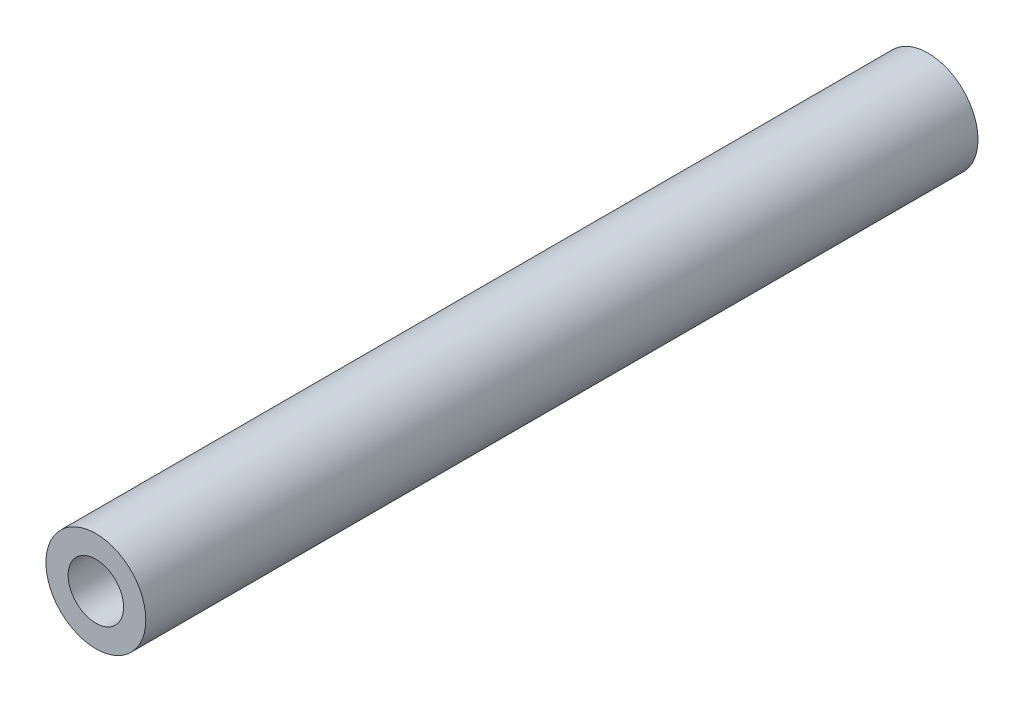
ISO-10303-21;
HEADER;
FILE_DESCRIPTION(('STEP AP214'),'2;1');
FILE_NAME('part.step','',(''),(''),'','','');
FILE_SCHEMA(('AUTOMOTIVE_DESIGN { 1 0 10303 214 1 1 1 1 }'));
ENDSEC;
DATA;
#1=APPLICATION_CONTEXT('core data for automotive mechanical design processes');
#2=APPLICATION_PROTOCOL_DEFINITION('international standard','automotive_design',2000,#1);
#3=PRODUCT_CONTEXT('',#1,'mechanical');
#4=PRODUCT('Part','Part','',(#3));
#5=PRODUCT_RELATED_PRODUCT_CATEGORY('part','',(#4));
#6=PRODUCT_DEFINITION_FORMATION('','',#4);
#7=PRODUCT_DEFINITION_CONTEXT('part definition',#1,'design');
#8=PRODUCT_DEFINITION('design','',#6,#7);
#9=PRODUCT_DEFINITION_SHAPE('','',#8);
#10=(LENGTH_UNIT() NAMED_UNIT(*) SI_UNIT(.MILLI.,.METRE.));
#11=(NAMED_UNIT(*) PLANE_ANGLE_UNIT() SI_UNIT($,.RADIAN.));
#12=(NAMED_UNIT(*) SI_UNIT($,.STERADIAN.) SOLID_ANGLE_UNIT());
#13=UNCERTAINTY_MEASURE_WITH_UNIT(LENGTH_MEASURE(1.E-05),#10,'distance_accuracy_value','');
#14=(GEOMETRIC_REPRESENTATION_CONTEXT(3) GLOBAL_UNCERTAINTY_ASSIGNED_CONTEXT((#13)) GLOBAL_UNIT_ASSIGNED_CONTEXT((#10,
#11,#12)) REPRESENTATION_CONTEXT('',''));
#15=CARTESIAN_POINT('',(0.,0.,0.));
#16=DIRECTION('',(0.,0.,1.));
#17=DIRECTION('',(1.,0.,0.));
#18=AXIS2_PLACEMENT_3D('',#15,#16,#17);
#19=CARTESIAN_POINT('',(0.,0.,375.));
#20=DIRECTION('',(0.,0.,-1.));
#21=DIRECTION('',(-1.,0.,0.));
#22=AXIS2_PLACEMENT_3D('',#19,#20,#21);
#23=CYLINDRICAL_SURFACE('',#22,22.5);
#24=CARTESIAN_POINT('',(0.,0.,375.));
#25=DIRECTION('',(0.,0.,1.));
#26=DIRECTION('',(1.,0.,0.));
#27=AXIS2_PLACEMENT_3D('',#24,#25,#26);
#28=CIRCLE('',#27,22.5);
#29=CARTESIAN_POINT('',(22.5,0.,375.));
#30=VERTEX_POINT('',#29);
#31=EDGE_CURVE('E11',#30,#30,#28,.T.);
#32=ORIENTED_EDGE('',*,*,#31,.F.);
#33=EDGE_LOOP('',(#32));
#34=FACE_BOUND('',#33,.T.);
#35=CARTESIAN_POINT('',(0.,0.,0.));
#36=DIRECTION('',(0.,0.,1.));
#37=DIRECTION('',(1.,0.,0.));
#38=AXIS2_PLACEMENT_3D('',#35,#36,#37);
#39=CIRCLE('',#38,22.5);
#40=CARTESIAN_POINT('',(22.5,0.,0.));
#41=VERTEX_POINT('',#40);
#42=EDGE_CURVE('E42',#41,#41,#39,.T.);
#43=ORIENTED_EDGE('',*,*,#42,.T.);
#44=EDGE_LOOP('',(#43));
#45=FACE_BOUND('',#44,.T.);
#46=ADVANCED_FACE('F39',(#34,#45),#23,.T.);
#47=CARTESIAN_POINT('',(0.,0.,375.));
#48=DIRECTION('',(0.,0.,1.));
#49=DIRECTION('',(1.,0.,0.));
#50=AXIS2_PLACEMENT_3D('',#47,#48,#49);
#51=PLANE('',#50);
#52=CARTESIAN_POINT('',(0.,0.,375.));
#53=DIRECTION('',(0.,0.,1.));
#54=DIRECTION('',(1.,0.,0.));
#55=AXIS2_PLACEMENT_3D('',#52,#53,#54);
#56=CIRCLE('',#55,12.5);
#57=CARTESIAN_POINT('',(12.5,0.,375.));
#58=VERTEX_POINT('',#57);
#59=EDGE_CURVE('E56',#58,#58,#56,.T.);
#60=ORIENTED_EDGE('',*,*,#59,.F.);
#61=EDGE_LOOP('',(#60));
#62=FACE_BOUND('',#61,.T.);
#63=ORIENTED_EDGE('',*,*,#31,.T.);
#64=EDGE_LOOP('',(#63));
#65=FACE_BOUND('',#64,.T.);
#66=ADVANCED_FACE('F63',(#62,#65),#51,.T.);
#67=CARTESIAN_POINT('',(0.,0.,0.));
#68=DIRECTION('',(0.,0.,1.));
#69=DIRECTION('',(1.,0.,0.));
#70=AXIS2_PLACEMENT_3D('',#67,#68,#69);
#71=PLANE('',#70);
#72=ORIENTED_EDGE('',*,*,#42,.F.);
#73=EDGE_LOOP('',(#72));
#74=FACE_BOUND('',#73,.T.);
#75=ADVANCED_FACE('F65',(#74),#71,.F.);
#76=CARTESIAN_POINT('',(0.,0.,-35.3553390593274));
#77=DIRECTION('',(0.,0.,1.));
#78=DIRECTION('',(1.,0.,0.));
#79=AXIS2_PLACEMENT_3D('',#76,#77,#78);
#80=CYLINDRICAL_SURFACE('',#79,12.5);
#81=CARTESIAN_POINT('',(0.,0.,5.));
#82=DIRECTION('',(0.,0.,1.));
#83=DIRECTION('',(1.,0.,0.));
#84=AXIS2_PLACEMENT_3D('',#81,#82,#83);
#85=CIRCLE('',#84,12.5);
#86=CARTESIAN_POINT('',(12.5,0.,5.));
#87=VERTEX_POINT('',#86);
#88=EDGE_CURVE('E51',#87,#87,#85,.F.);
#89=ORIENTED_EDGE('',*,*,#88,.T.);
#90=EDGE_LOOP('',(#89));
#91=FACE_BOUND('',#90,.T.);
#92=ORIENTED_EDGE('',*,*,#59,.T.);
#93=EDGE_LOOP('',(#92));
#94=FACE_BOUND('',#93,.T.);
#95=ADVANCED_FACE('F61',(#91,#94),#80,.F.);
#96=CARTESIAN_POINT('',(0.,0.,5.));
#97=DIRECTION('',(0.,0.,1.));
#98=DIRECTION('',(1.,0.,0.));
#99=AXIS2_PLACEMENT_3D('',#96,#97,#98);
#100=PLANE('',#99);
#101=ORIENTED_EDGE('',*,*,#88,.F.);
#102=EDGE_LOOP('',(#101));
#103=FACE_BOUND('',#102,.T.);
#104=ADVANCED_FACE('F76',(#103),#100,.T.);
#105=CLOSED_SHELL('',(#46,#66,#75,#95,#104));
#106=MANIFOLD_SOLID_BREP('B2',#105);
#107=ADVANCED_BREP_SHAPE_REPRESENTATION('',(#18,#106),#14);
#108=SHAPE_DEFINITION_REPRESENTATION(#9,#107);
ENDSEC;
END-ISO-10303-21;
